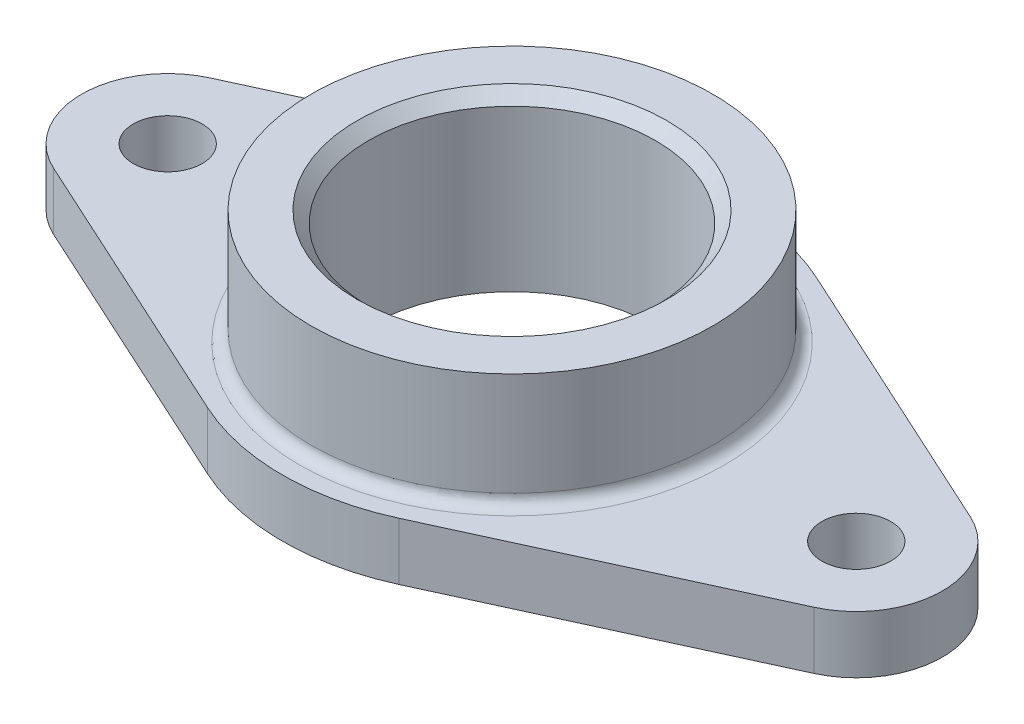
from build123d import *

# Parameters (mm, degrees)
EXTRUDE_1_DEPTH     = 10
SKETCH_3_R          = 35
EXTRUDE_2_DEPTH     = 30
SKETCH_4_R          = 25
CUT_EXTRUDE_1_DEPTH = 91.138781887
SKETCH_5_R          = 6
CUT_EXTRUDE_2_DEPTH = 91.138781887
CHAMFER_1_SIZE      = 2
FILLET_1_R          = 2


with BuildPart() as part:
    # Sketch 2 → Extrude 1 (new body)
    with BuildSketch(Plane(origin=(0, 0, 0), x_dir=(1, 0, 0), z_dir=(0, 1, 0))):
        with BuildLine():
            Line((-66.25, 13.635890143), (-16.666666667, 36.362373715))
            ThreePointArc((-16.666666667, 36.362373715), (0, 40), (16.666666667, 36.362373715))
            Line((16.666666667, 36.362373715), (66.25, 13.635890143))
            ThreePointArc((66.25, 13.635890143), (75, 0), (66.25, -13.635890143))
            Line((66.25, -13.635890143), (16.666666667, -36.362373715))
            ThreePointArc((16.666666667, -36.362373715), (0, -40), (-16.666666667, -36.362373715))
            Line((-16.666666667, -36.362373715), (-66.25, -13.635890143))
            ThreePointArc((-66.25, -13.635890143), (-75, 0), (-66.25, 13.635890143))
        make_face()
    extrude(amount=EXTRUDE_1_DEPTH)

    # Sketch 3 → Extrude 2 (add)
    with BuildSketch(Plane(origin=(0, 0, 0), x_dir=(1, 0, 0), z_dir=(0, 1, 0))):
        with Locations(Location((0, 0, 0), (0, 0, 270))):
            Circle(SKETCH_3_R)
    extrude(amount=EXTRUDE_2_DEPTH)

    # Sketch 4 → Cut-Extrude 1 (cut, through all)
    with BuildSketch(Plane(origin=(0, 0, 0), x_dir=(1, 0, 0), z_dir=(0, 1, 0))):
        with Locations(Location((0, 0, 0), (0, 0, 270))):
            Circle(SKETCH_4_R)
    extrude(amount=CUT_EXTRUDE_1_DEPTH, mode=Mode.SUBTRACT)

    # Sketch 5 → Cut-Extrude 2 (cut, through all)
    with BuildSketch(Plane(origin=(0, 0, 0), x_dir=(1, 0, 0), z_dir=(0, 1, 0))):
        with Locations(Location((-60, 0, 0), (0, 0, 270))):
            Circle(SKETCH_5_R)
        with Locations(Location((60, 0, 0), (0, 0, 270))):
            Circle(SKETCH_5_R)
    extrude(amount=CUT_EXTRUDE_2_DEPTH, mode=Mode.SUBTRACT)

    # Chamfer 1
    chamfer_1_edges = [part.edges().sort_by_distance(p)[0] for p in [
        (0, 30, -25),
    ]]
    chamfer(chamfer_1_edges, length=CHAMFER_1_SIZE)

    # Fillet 1
    fillet_1_edges = [part.edges().sort_by_distance(p)[0] for p in [
        (0, 10, -35),
    ]]
    fillet(fillet_1_edges, radius=FILLET_1_R)


solid = part.part
